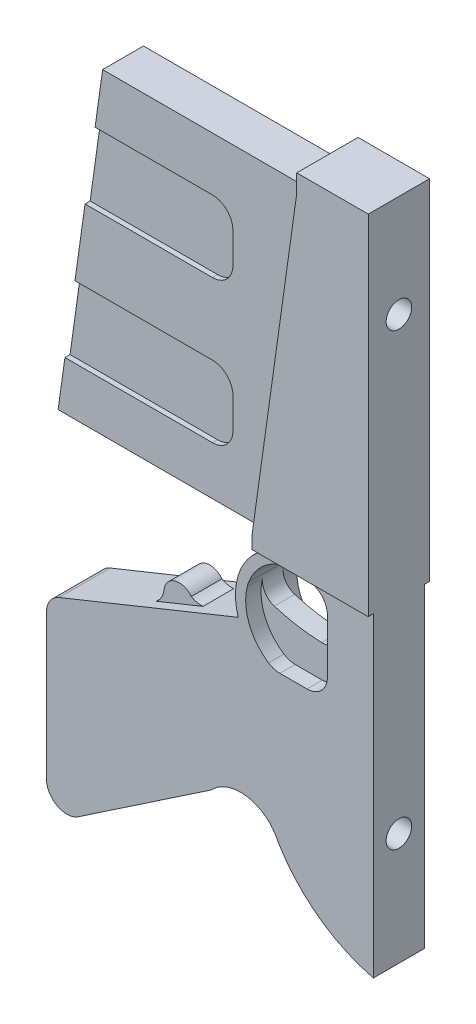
from build123d import *

# Parameters (mm, degrees)
EXTRUDE_3_DEPTH        = 5
EXTRUDE_4_DEPTH        = 6
EXTRUDE_5_DEPTH        = 3
EXTRUDE_6_DEPTH        = 2
EXTRUDE_7_DEPTH        = 4
EXTRUDE_8_DEPTH        = 3
HOLE_WIZARD_M6_1_D     = 5
HOLE_WIZARD_M6_1_DEPTH = 15
HOLE_WIZARD_M6_1_TIP   = 1.502151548


with BuildPart() as part:
    # Sketch 1 → Extrude 3 (new, symmetric)
    with BuildSketch(Plane.XY):
        with BuildLine():
            ThreePointArc((-18.644681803, 13.718737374), (-10.698791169, 4.988680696), (0, 0))
            Line((0, 0), (0, 61.742184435))
            Line((0, 61.742184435), (-22.713531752, 61.742184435))
            Line((-22.713531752, 61.742184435), (-22.713531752, 60.692465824))
            ThreePointArc((-22.713531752, 60.692465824), (-23.901718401, 59.547323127), (-24.921567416, 58.25))
            ThreePointArc((-24.921567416, 58.25), (-26.870411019, 53.258789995), (-26.452577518, 47.916919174))
            Line((-26.452577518, 47.916919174), (-35.355953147, 44.319721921))
            Line((-35.355953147, 44.319721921), (-44.479669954, 40.633501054))
            Line((-44.479669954, 40.633501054), (-61.498426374, 33.75747713))
            ThreePointArc((-61.498426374, 33.75747713), (-63.31615029, 32.285513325), (-64, 30.048741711))
            Line((-64, 30.048741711), (-64, 1.76968164))
            ThreePointArc((-64, 1.76968164), (-61.877886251, -1.762108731), (-57.763228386, -1.54646865))
            Line((-57.763228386, -1.54646865), (-31.827288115, 15.947543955))
            ThreePointArc((-31.827288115, 15.947543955), (-24.634949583, 18.388053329), (-18.644681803, 13.718737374))
        make_face()
        with BuildLine():
            ThreePointArc((-18.996526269, 60.666666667), (-18.214412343, 60.915780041), (-17.397915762, 61))
            Line((-17.397915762, 61), (-13, 61))
            ThreePointArc((-13, 61), (-10.171572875, 59.828427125), (-9, 57))
            Line((-9, 57), (-9, 52.81306727))
            Line((-9, 52.81306727), (-9, 46.5))
            ThreePointArc((-9, 46.5), (-10.171572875, 43.671572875), (-13, 42.5))
            Line((-13, 42.5), (-18.31662479, 42.5))
            ThreePointArc((-18.31662479, 42.5), (-19.471325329, 42.670291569), (-20.527707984, 43.166666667))
            ThreePointArc((-20.527707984, 43.166666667), (-24.339180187, 47.925127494), (-24.679253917, 54.012378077))
            ThreePointArc((-24.679253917, 54.012378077), (-24.571344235, 54.474900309), (-24.398053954, 54.917101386))
            ThreePointArc((-24.398053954, 54.917101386), (-22.288214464, 58.347038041), (-18.996526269, 60.666666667))
        make_face(mode=Mode.SUBTRACT)
    extrude(amount=EXTRUDE_3_DEPTH, both=True)

    # Sketch 1_5 → Extrude 4 (add, symmetric)
    with BuildSketch(Plane.XY):
        Polygon((-22.713531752, 61.742184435), (0, 61.742184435), (0, 130), (-14, 130), (-14, 126.5), (-22.713531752, 64.5), align=None)
    extrude(amount=EXTRUDE_4_DEPTH, both=True)

    # Sketch 1_6 → Extrude 5 (add, symmetric)
    with BuildSketch(Plane.XY):
        with BuildLine():
            Line((-44.479669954, 40.633501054), (-35.355953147, 44.319721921))
            ThreePointArc((-35.355953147, 44.319721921), (-36.536531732, 44.417893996), (-37.636580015, 44.857549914))
            ThreePointArc((-37.636580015, 44.857549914), (-40.75509027, 45.913200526), (-42.964177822, 43.472004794))
            ThreePointArc((-42.964177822, 43.472004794), (-43.423916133, 41.89364501), (-44.479669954, 40.633501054))
        make_face()
    extrude(amount=EXTRUDE_5_DEPTH, both=True)

    # Sketch 1_8 → Extrude 6 (add, symmetric)
    with BuildSketch(Plane.XY):
        with BuildLine():
            Line((-9, 46.5), (-9, 52.81306727))
            ThreePointArc((-9, 52.81306727), (-10.212933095, 49.943876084), (-13.116129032, 48.81475337))
            ThreePointArc((-13.116129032, 48.81475337), (-17.806885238, 49.268399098), (-22.394176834, 50.348095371))
            ThreePointArc((-22.394176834, 50.348095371), (-24.220763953, 51.753658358), (-24.679253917, 54.012378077))
            ThreePointArc((-24.679253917, 54.012378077), (-24.339180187, 47.925127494), (-20.527707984, 43.166666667))
            ThreePointArc((-20.527707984, 43.166666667), (-19.471325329, 42.670291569), (-18.31662479, 42.5))
            Line((-18.31662479, 42.5), (-13, 42.5))
            ThreePointArc((-13, 42.5), (-10.171572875, 43.671572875), (-9, 46.5))
        make_face()
    extrude(amount=EXTRUDE_6_DEPTH, both=True)

    # Sketch 1_9 → Extrude 7 (add, symmetric)
    with BuildSketch(Plane.XY):
        with BuildLine():
            Line((-28.228756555, 64.5), (-22.713531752, 64.5))
            Line((-22.713531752, 64.5), (-14, 126.5))
            Line((-14, 126.5), (-54, 126.5))
            Line((-54, 126.5), (-55.475678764, 116))
            Line((-55.475678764, 116), (-32.5, 116))
            ThreePointArc((-32.5, 116), (-29.671572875, 114.828427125), (-28.5, 112))
            Line((-28.5, 112), (-28.5, 106))
            ThreePointArc((-28.5, 106), (-29.671572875, 103.171572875), (-32.5, 102))
            Line((-32.5, 102), (-57.44325045, 102))
            Line((-57.44325045, 102), (-59.410822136, 88))
            Line((-59.410822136, 88), (-32.5, 88))
            ThreePointArc((-32.5, 88), (-29.671572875, 86.828427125), (-28.5, 84))
            Line((-28.5, 84), (-28.5, 78))
            ThreePointArc((-28.5, 78), (-29.671572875, 75.171572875), (-32.5, 74))
            Line((-32.5, 74), (-61.378393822, 74))
            Line((-61.378393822, 74), (-62.713531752, 64.5))
            Line((-62.713531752, 64.5), (-28.228756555, 64.5))
        make_face()
    extrude(amount=EXTRUDE_7_DEPTH, both=True)

    # Sketch 1_10 → Extrude 8 (add, symmetric)
    with BuildSketch(Plane.XY):
        with BuildLine():
            Line((-32.5, 116), (-55.475678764, 116))
            Line((-55.475678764, 116), (-57.44325045, 102))
            Line((-57.44325045, 102), (-32.5, 102))
            ThreePointArc((-32.5, 102), (-29.671572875, 103.171572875), (-28.5, 106))
            Line((-28.5, 106), (-28.5, 112))
            ThreePointArc((-28.5, 112), (-29.671572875, 114.828427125), (-32.5, 116))
        make_face()
        with BuildLine():
            Line((-59.410822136, 88), (-61.378393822, 74))
            Line((-61.378393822, 74), (-32.5, 74))
            ThreePointArc((-32.5, 74), (-29.671572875, 75.171572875), (-28.5, 78))
            Line((-28.5, 78), (-28.5, 84))
            ThreePointArc((-28.5, 84), (-29.671572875, 86.828427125), (-32.5, 88))
            Line((-32.5, 88), (-59.410822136, 88))
        make_face()
    extrude(amount=EXTRUDE_8_DEPTH, both=True)

    # Hole Wizard M6 _1
    with Locations(Plane(origin=(0, 0, 0), x_dir=(0, 0, -1), z_dir=(1, 0, 0))):
        with Locations((0, 110), (0, 22)):
            Hole(HOLE_WIZARD_M6_1_D / 2, depth=HOLE_WIZARD_M6_1_DEPTH)
            with Locations((0, 0, -(HOLE_WIZARD_M6_1_DEPTH + HOLE_WIZARD_M6_1_TIP / 2))):  # 118° drill point
                Cone(0, HOLE_WIZARD_M6_1_D / 2, HOLE_WIZARD_M6_1_TIP, mode=Mode.SUBTRACT)


solid = part.part
